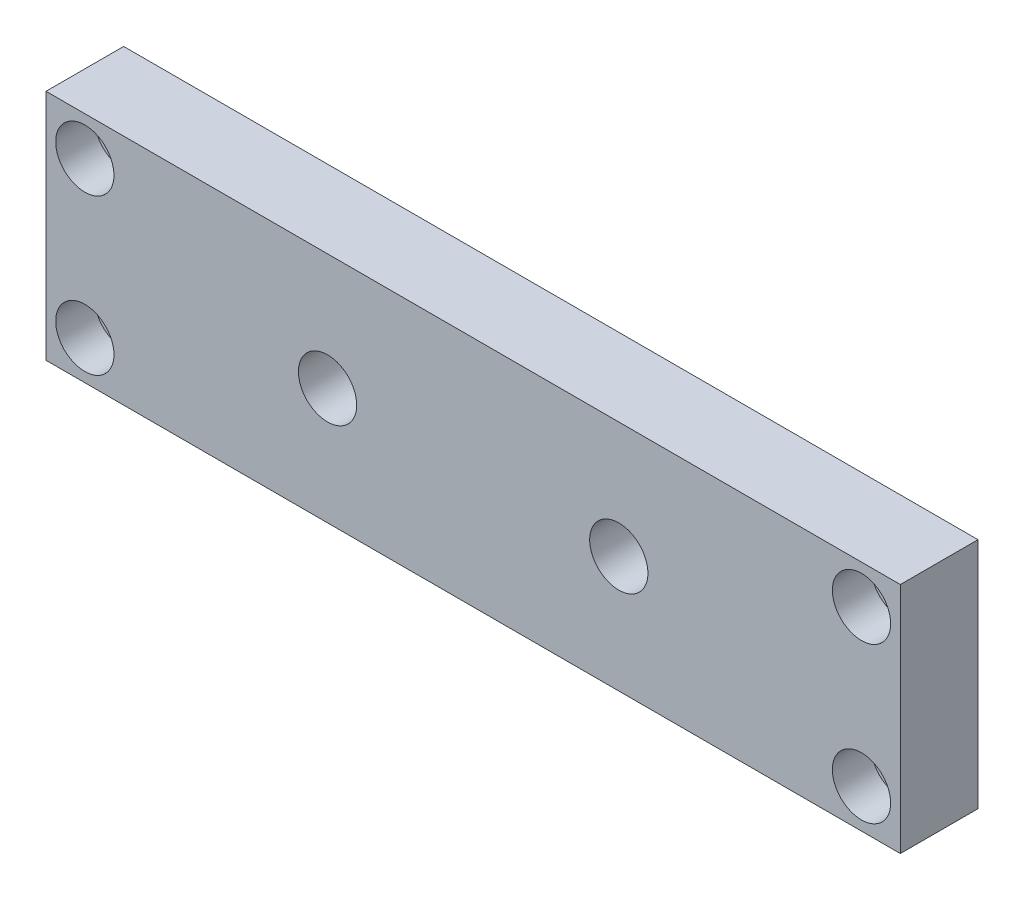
from build123d import *

# Parameters (mm, degrees)
SKETCH1_W           = 139.7
SKETCH1_H           = 38.1
SKETCH1_R           = 3.175
SKETCH1_R_2         = 4.7625
BOSS_EXTRUDE1_DEPTH = 12.7
SKETCH2_R           = 4.7625
CUT_EXTRUDE1_DEPTH  = 6.35
SKETCH3_R           = 3.175
CUT_EXTRUDE2_DEPTH  = 20.32
CHAMFER1_SIZE       = 1.778
CHAMFER1_SIZE2      = 2.95908892


with BuildPart() as part:
    # Sketch1 → Boss-Extrude1 (new body)
    with BuildSketch(Plane.XY):
        Rectangle(SKETCH1_W, SKETCH1_H)
        with Locations((-63.5, 12.7)):
            Circle(SKETCH1_R, mode=Mode.SUBTRACT)
        with Locations((-63.5, -12.7)):
            Circle(SKETCH1_R, mode=Mode.SUBTRACT)
        with Locations((63.5, 12.7)):
            Circle(SKETCH1_R, mode=Mode.SUBTRACT)
        with Locations((63.5, -12.7)):
            Circle(SKETCH1_R, mode=Mode.SUBTRACT)
        with Locations((-23.8125, 0)):
            Circle(SKETCH1_R_2, mode=Mode.SUBTRACT)
        with Locations((23.8125, 0)):
            Circle(SKETCH1_R_2, mode=Mode.SUBTRACT)
    extrude(amount=BOSS_EXTRUDE1_DEPTH)

    # Sketch2 → Cut-Extrude1 (cut)
    with BuildSketch(Plane.XY.offset(12.7)):
        with Locations((-63.5, 12.7)):
            Circle(SKETCH2_R)
        with Locations((-63.5, -12.7)):
            Circle(SKETCH2_R)
        with Locations((63.5, -12.7)):
            Circle(SKETCH2_R)
        with Locations((63.5, 12.7)):
            Circle(SKETCH2_R)
    extrude(amount=-CUT_EXTRUDE1_DEPTH, mode=Mode.SUBTRACT)

    # Sketch3 → Cut-Extrude2 (cut)
    with BuildSketch(Plane.XZ.offset(19.05)):
        with Locations(Location((0, 6.35, 0), (0, 0, 270))):
            Circle(SKETCH3_R)
    extrude(amount=-CUT_EXTRUDE2_DEPTH, mode=Mode.SUBTRACT)

    # Chamfer1
    chamfer1_edges = [part.edges().sort_by_distance(p)[0] for p in [
        (0, 1.27, 9.525),
    ]]
    chamfer1_side = [part.faces().sort_by_distance(p)[0] for p in [
        (0, -8.89, 9.525),
    ]]
    chamfer(chamfer1_edges, length=CHAMFER1_SIZE, length2=CHAMFER1_SIZE2, reference=chamfer1_side[0])


solid = part.part
